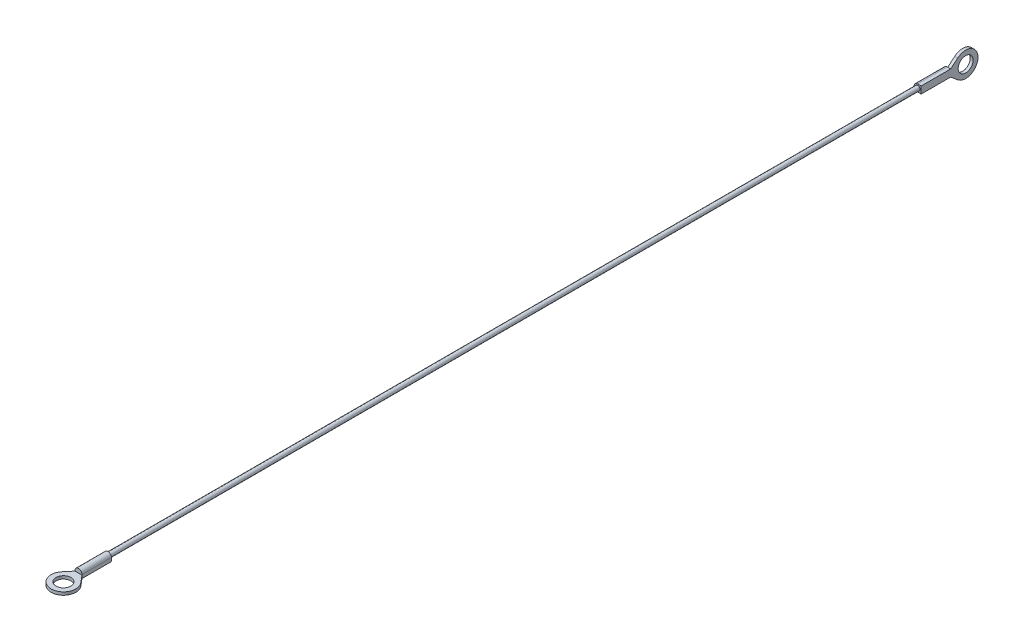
ISO-10303-21;
HEADER;
FILE_DESCRIPTION(('STEP AP214'),'2;1');
FILE_NAME('part.step','',(''),(''),'','','');
FILE_SCHEMA(('AUTOMOTIVE_DESIGN { 1 0 10303 214 1 1 1 1 }'));
ENDSEC;
DATA;
#1=APPLICATION_CONTEXT('core data for automotive mechanical design processes');
#2=APPLICATION_PROTOCOL_DEFINITION('international standard','automotive_design',2000,#1);
#3=PRODUCT_CONTEXT('',#1,'mechanical');
#4=PRODUCT('Part','Part','',(#3));
#5=PRODUCT_RELATED_PRODUCT_CATEGORY('part','',(#4));
#6=PRODUCT_DEFINITION_FORMATION('','',#4);
#7=PRODUCT_DEFINITION_CONTEXT('part definition',#1,'design');
#8=PRODUCT_DEFINITION('design','',#6,#7);
#9=PRODUCT_DEFINITION_SHAPE('','',#8);
#10=(LENGTH_UNIT() NAMED_UNIT(*) SI_UNIT(.MILLI.,.METRE.));
#11=(NAMED_UNIT(*) PLANE_ANGLE_UNIT() SI_UNIT($,.RADIAN.));
#12=(NAMED_UNIT(*) SI_UNIT($,.STERADIAN.) SOLID_ANGLE_UNIT());
#13=UNCERTAINTY_MEASURE_WITH_UNIT(LENGTH_MEASURE(1.E-05),#10,'distance_accuracy_value','');
#14=(GEOMETRIC_REPRESENTATION_CONTEXT(3) GLOBAL_UNCERTAINTY_ASSIGNED_CONTEXT((#13)) GLOBAL_UNIT_ASSIGNED_CONTEXT((#10,
#11,#12)) REPRESENTATION_CONTEXT('',''));
#15=CARTESIAN_POINT('',(0.,0.,0.));
#16=DIRECTION('',(0.,0.,1.));
#17=DIRECTION('',(1.,0.,0.));
#18=AXIS2_PLACEMENT_3D('',#15,#16,#17);
#19=CARTESIAN_POINT('',(0.,0.,-147.32));
#20=DIRECTION('',(0.,0.,-1.));
#21=DIRECTION('',(-1.,0.,0.));
#22=AXIS2_PLACEMENT_3D('',#19,#20,#21);
#23=PLANE('',#22);
#24=DIRECTION('',(1.,0.,0.));
#25=VECTOR('',#24,1.);
#26=CARTESIAN_POINT('',(0.,1.195,-147.32));
#27=LINE('',#26,#25);
#28=CARTESIAN_POINT('',(0.,1.195,-147.32));
#29=VERTEX_POINT('',#28);
#30=CARTESIAN_POINT('',(0.185,1.195,-147.32));
#31=VERTEX_POINT('',#30);
#32=EDGE_CURVE('E196',#29,#31,#27,.T.);
#33=ORIENTED_EDGE('',*,*,#32,.T.);
#34=DIRECTION('',(0.,-1.,0.));
#35=VECTOR('',#34,1.);
#36=CARTESIAN_POINT('',(0.185,-1.195,-147.32));
#37=LINE('',#36,#35);
#38=CARTESIAN_POINT('',(0.185,-1.195,-147.32));
#39=VERTEX_POINT('',#38);
#40=EDGE_CURVE('E154',#31,#39,#37,.T.);
#41=ORIENTED_EDGE('',*,*,#40,.T.);
#42=DIRECTION('',(-1.,0.,0.));
#43=VECTOR('',#42,1.);
#44=CARTESIAN_POINT('',(1.195,-1.195,-147.32));
#45=LINE('',#44,#43);
#46=CARTESIAN_POINT('',(0.,-1.195,-147.32));
#47=VERTEX_POINT('',#46);
#48=EDGE_CURVE('E201',#39,#47,#45,.T.);
#49=ORIENTED_EDGE('',*,*,#48,.T.);
#50=CARTESIAN_POINT('',(0.,0.,-147.32));
#51=DIRECTION('',(0.,0.,-1.));
#52=DIRECTION('',(-1.,0.,0.));
#53=AXIS2_PLACEMENT_3D('',#50,#51,#52);
#54=CIRCLE('',#53,1.195);
#55=EDGE_CURVE('E192',#47,#29,#54,.T.);
#56=ORIENTED_EDGE('',*,*,#55,.T.);
#57=EDGE_LOOP('',(#33,#41,#49,#56));
#58=FACE_BOUND('',#57,.T.);
#59=ADVANCED_FACE('F39',(#58),#23,.T.);
#60=CARTESIAN_POINT('',(0.,0.,147.32));
#61=DIRECTION('',(0.,0.,1.));
#62=DIRECTION('',(1.,0.,0.));
#63=AXIS2_PLACEMENT_3D('',#60,#61,#62);
#64=PLANE('',#63);
#65=DIRECTION('',(0.,-1.,0.));
#66=VECTOR('',#65,1.);
#67=CARTESIAN_POINT('',(-1.195,0.,147.32));
#68=LINE('',#67,#66);
#69=CARTESIAN_POINT('',(-1.195,0.,147.32));
#70=VERTEX_POINT('',#69);
#71=CARTESIAN_POINT('',(-1.195,-0.185,147.32));
#72=VERTEX_POINT('',#71);
#73=EDGE_CURVE('E279',#70,#72,#68,.T.);
#74=ORIENTED_EDGE('',*,*,#73,.T.);
#75=DIRECTION('',(1.,0.,0.));
#76=VECTOR('',#75,1.);
#77=CARTESIAN_POINT('',(-1.195,-0.185,147.32));
#78=LINE('',#77,#76);
#79=CARTESIAN_POINT('',(1.195,-0.185,147.32));
#80=VERTEX_POINT('',#79);
#81=EDGE_CURVE('E241',#72,#80,#78,.T.);
#82=ORIENTED_EDGE('',*,*,#81,.T.);
#83=DIRECTION('',(0.,1.,0.));
#84=VECTOR('',#83,1.);
#85=CARTESIAN_POINT('',(1.195,-1.195,147.32));
#86=LINE('',#85,#84);
#87=CARTESIAN_POINT('',(1.195,0.,147.32));
#88=VERTEX_POINT('',#87);
#89=EDGE_CURVE('E284',#80,#88,#86,.T.);
#90=ORIENTED_EDGE('',*,*,#89,.T.);
#91=CARTESIAN_POINT('',(0.,0.,147.32));
#92=DIRECTION('',(0.,0.,1.));
#93=DIRECTION('',(1.,0.,0.));
#94=AXIS2_PLACEMENT_3D('',#91,#92,#93);
#95=CIRCLE('',#94,1.195);
#96=EDGE_CURVE('E275',#88,#70,#95,.T.);
#97=ORIENTED_EDGE('',*,*,#96,.T.);
#98=EDGE_LOOP('',(#74,#82,#90,#97));
#99=FACE_BOUND('',#98,.T.);
#100=ADVANCED_FACE('F339',(#99),#64,.T.);
#101=CARTESIAN_POINT('',(0.,0.,137.32));
#102=DIRECTION('',(0.,0.,-1.));
#103=DIRECTION('',(-1.,0.,0.));
#104=AXIS2_PLACEMENT_3D('',#101,#102,#103);
#105=CYLINDRICAL_SURFACE('',#104,0.795);
#106=CARTESIAN_POINT('',(0.,0.,137.32));
#107=DIRECTION('',(0.,0.,1.));
#108=DIRECTION('',(1.,0.,0.));
#109=AXIS2_PLACEMENT_3D('',#106,#107,#108);
#110=CIRCLE('',#109,0.795);
#111=CARTESIAN_POINT('',(0.795,0.,137.32));
#112=VERTEX_POINT('',#111);
#113=EDGE_CURVE('E11',#112,#112,#110,.T.);
#114=ORIENTED_EDGE('',*,*,#113,.F.);
#115=EDGE_LOOP('',(#114));
#116=FACE_BOUND('',#115,.T.);
#117=CARTESIAN_POINT('',(0.,0.,-137.32));
#118=DIRECTION('',(0.,0.,1.));
#119=DIRECTION('',(1.,0.,0.));
#120=AXIS2_PLACEMENT_3D('',#117,#118,#119);
#121=CIRCLE('',#120,0.795);
#122=CARTESIAN_POINT('',(0.795,0.,-137.32));
#123=VERTEX_POINT('',#122);
#124=EDGE_CURVE('E43',#123,#123,#121,.T.);
#125=ORIENTED_EDGE('',*,*,#124,.T.);
#126=EDGE_LOOP('',(#125));
#127=FACE_BOUND('',#126,.T.);
#128=ADVANCED_FACE('F41',(#116,#127),#105,.T.);
#129=CARTESIAN_POINT('',(0.,0.,147.32));
#130=DIRECTION('',(0.,0.,-1.));
#131=DIRECTION('',(-1.,0.,0.));
#132=AXIS2_PLACEMENT_3D('',#129,#130,#131);
#133=CYLINDRICAL_SURFACE('',#132,1.195);
#134=CARTESIAN_POINT('',(0.,0.,137.32));
#135=DIRECTION('',(0.,0.,1.));
#136=DIRECTION('',(1.,0.,0.));
#137=AXIS2_PLACEMENT_3D('',#134,#135,#136);
#138=CIRCLE('',#137,1.195);
#139=CARTESIAN_POINT('',(1.195,0.,137.32));
#140=VERTEX_POINT('',#139);
#141=CARTESIAN_POINT('',(-1.195,0.,137.32));
#142=VERTEX_POINT('',#141);
#143=EDGE_CURVE('E270',#140,#142,#138,.T.);
#144=ORIENTED_EDGE('',*,*,#143,.T.);
#145=DIRECTION('',(0.,0.,-1.));
#146=VECTOR('',#145,1.);
#147=CARTESIAN_POINT('',(-1.195,0.,147.32));
#148=LINE('',#147,#146);
#149=EDGE_CURVE('E49',#70,#142,#148,.T.);
#150=ORIENTED_EDGE('',*,*,#149,.F.);
#151=ORIENTED_EDGE('',*,*,#96,.F.);
#152=DIRECTION('',(0.,0.,-1.));
#153=VECTOR('',#152,1.);
#154=CARTESIAN_POINT('',(1.195,0.,147.32));
#155=LINE('',#154,#153);
#156=EDGE_CURVE('E288',#88,#140,#155,.T.);
#157=ORIENTED_EDGE('',*,*,#156,.T.);
#158=EDGE_LOOP('',(#144,#150,#151,#157));
#159=FACE_BOUND('',#158,.T.);
#160=ADVANCED_FACE('F323',(#159),#133,.T.);
#161=CARTESIAN_POINT('',(-1.195,0.,147.32));
#162=DIRECTION('',(1.,0.,0.));
#163=DIRECTION('',(0.,1.,0.));
#164=AXIS2_PLACEMENT_3D('',#161,#162,#163);
#165=PLANE('',#164);
#166=DIRECTION('',(0.,-1.,0.));
#167=VECTOR('',#166,1.);
#168=CARTESIAN_POINT('',(-1.195,0.,137.32));
#169=LINE('',#168,#167);
#170=CARTESIAN_POINT('',(-1.195,-1.195,137.32));
#171=VERTEX_POINT('',#170);
#172=EDGE_CURVE('E292',#142,#171,#169,.T.);
#173=ORIENTED_EDGE('',*,*,#172,.T.);
#174=DIRECTION('',(0.,0.,-1.));
#175=VECTOR('',#174,1.);
#176=CARTESIAN_POINT('',(-1.195,-1.195,147.32));
#177=LINE('',#176,#175);
#178=CARTESIAN_POINT('',(-1.195,-1.195,147.32));
#179=VERTEX_POINT('',#178);
#180=EDGE_CURVE('E308',#179,#171,#177,.T.);
#181=ORIENTED_EDGE('',*,*,#180,.F.);
#182=DIRECTION('',(0.,-1.,0.));
#183=VECTOR('',#182,1.);
#184=CARTESIAN_POINT('',(-1.195,-0.185,147.32));
#185=LINE('',#184,#183);
#186=EDGE_CURVE('E267',#72,#179,#185,.T.);
#187=ORIENTED_EDGE('',*,*,#186,.F.);
#188=ORIENTED_EDGE('',*,*,#73,.F.);
#189=ORIENTED_EDGE('',*,*,#149,.T.);
#190=EDGE_LOOP('',(#173,#181,#187,#188,#189));
#191=FACE_BOUND('',#190,.T.);
#192=ADVANCED_FACE('F317',(#191),#165,.F.);
#193=CARTESIAN_POINT('',(0.,-1.195,147.32));
#194=DIRECTION('',(0.,1.,0.));
#195=DIRECTION('',(0.,0.,1.));
#196=AXIS2_PLACEMENT_3D('',#193,#194,#195);
#197=PLANE('',#196);
#198=DIRECTION('',(1.,0.,0.));
#199=VECTOR('',#198,1.);
#200=CARTESIAN_POINT('',(0.,-1.195,137.32));
#201=LINE('',#200,#199);
#202=CARTESIAN_POINT('',(1.195,-1.195,137.32));
#203=VERTEX_POINT('',#202);
#204=EDGE_CURVE('E296',#171,#203,#201,.T.);
#205=ORIENTED_EDGE('',*,*,#204,.T.);
#206=DIRECTION('',(0.,0.,-1.));
#207=VECTOR('',#206,1.);
#208=CARTESIAN_POINT('',(1.195,-1.195,147.32));
#209=LINE('',#208,#207);
#210=CARTESIAN_POINT('',(1.195,-1.195,147.32));
#211=VERTEX_POINT('',#210);
#212=EDGE_CURVE('E304',#211,#203,#209,.T.);
#213=ORIENTED_EDGE('',*,*,#212,.F.);
#214=DIRECTION('',(0.645049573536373,0.,0.764140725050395));
#215=VECTOR('',#214,1.);
#216=CARTESIAN_POINT('',(1.195,-1.195,147.32));
#217=LINE('',#216,#215);
#218=CARTESIAN_POINT('',(3.20174963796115,-1.195,149.697242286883));
#219=VERTEX_POINT('',#218);
#220=EDGE_CURVE('E236',#211,#219,#217,.T.);
#221=ORIENTED_EDGE('',*,*,#220,.T.);
#222=CARTESIAN_POINT('',(0.,-1.195,152.4));
#223=DIRECTION('',(0.,-1.,0.));
#224=DIRECTION('',(0.,0.,-1.));
#225=AXIS2_PLACEMENT_3D('',#222,#223,#224);
#226=CIRCLE('',#225,4.19);
#227=CARTESIAN_POINT('',(-3.20174963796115,-1.195,149.697242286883));
#228=VERTEX_POINT('',#227);
#229=EDGE_CURVE('E260',#219,#228,#226,.T.);
#230=ORIENTED_EDGE('',*,*,#229,.T.);
#231=DIRECTION('',(0.645049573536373,0.,-0.764140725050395));
#232=VECTOR('',#231,1.);
#233=CARTESIAN_POINT('',(-3.20174963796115,-1.195,149.697242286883));
#234=LINE('',#233,#232);
#235=EDGE_CURVE('E245',#228,#179,#234,.T.);
#236=ORIENTED_EDGE('',*,*,#235,.T.);
#237=ORIENTED_EDGE('',*,*,#180,.T.);
#238=EDGE_LOOP('',(#205,#213,#221,#230,#236,#237));
#239=FACE_BOUND('',#238,.T.);
#240=CARTESIAN_POINT('',(0.,-1.195,152.4));
#241=DIRECTION('',(0.,-1.,0.));
#242=DIRECTION('',(0.,0.,-1.));
#243=AXIS2_PLACEMENT_3D('',#240,#241,#242);
#244=CIRCLE('',#243,2.54);
#245=CARTESIAN_POINT('',(0.,-1.195,149.86));
#246=VERTEX_POINT('',#245);
#247=EDGE_CURVE('E237',#246,#246,#244,.T.);
#248=ORIENTED_EDGE('',*,*,#247,.F.);
#249=EDGE_LOOP('',(#248));
#250=FACE_BOUND('',#249,.T.);
#251=ADVANCED_FACE('F330',(#239,#250),#197,.F.);
#252=CARTESIAN_POINT('',(1.195,-1.195,147.32));
#253=DIRECTION('',(-1.,0.,0.));
#254=DIRECTION('',(0.,-1.,0.));
#255=AXIS2_PLACEMENT_3D('',#252,#253,#254);
#256=PLANE('',#255);
#257=DIRECTION('',(0.,1.,0.));
#258=VECTOR('',#257,1.);
#259=CARTESIAN_POINT('',(1.195,-1.195,137.32));
#260=LINE('',#259,#258);
#261=EDGE_CURVE('E280',#203,#140,#260,.T.);
#262=ORIENTED_EDGE('',*,*,#261,.T.);
#263=ORIENTED_EDGE('',*,*,#156,.F.);
#264=ORIENTED_EDGE('',*,*,#89,.F.);
#265=EDGE_CURVE('E285',#211,#80,#86,.T.);
#266=ORIENTED_EDGE('',*,*,#265,.F.);
#267=ORIENTED_EDGE('',*,*,#212,.T.);
#268=EDGE_LOOP('',(#262,#263,#264,#266,#267));
#269=FACE_BOUND('',#268,.T.);
#270=ADVANCED_FACE('F334',(#269),#256,.F.);
#271=CARTESIAN_POINT('',(0.,0.,137.32));
#272=DIRECTION('',(0.,0.,1.));
#273=DIRECTION('',(1.,0.,0.));
#274=AXIS2_PLACEMENT_3D('',#271,#272,#273);
#275=PLANE('',#274);
#276=ORIENTED_EDGE('',*,*,#113,.T.);
#277=EDGE_LOOP('',(#276));
#278=FACE_BOUND('',#277,.T.);
#279=ORIENTED_EDGE('',*,*,#143,.F.);
#280=ORIENTED_EDGE('',*,*,#261,.F.);
#281=ORIENTED_EDGE('',*,*,#204,.F.);
#282=ORIENTED_EDGE('',*,*,#172,.F.);
#283=EDGE_LOOP('',(#279,#280,#281,#282));
#284=FACE_BOUND('',#283,.T.);
#285=ADVANCED_FACE('F327',(#278,#284),#275,.F.);
#286=CARTESIAN_POINT('',(-3.20174963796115,-0.185,149.697242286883));
#287=DIRECTION('',(-0.764140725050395,0.,-0.645049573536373));
#288=DIRECTION('',(-0.645049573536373,0.,0.764140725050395));
#289=AXIS2_PLACEMENT_3D('',#286,#287,#288);
#290=PLANE('',#289);
#291=ORIENTED_EDGE('',*,*,#235,.F.);
#292=DIRECTION('',(0.,-1.,0.));
#293=VECTOR('',#292,1.);
#294=CARTESIAN_POINT('',(-3.20174963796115,-0.185,149.697242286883));
#295=LINE('',#294,#293);
#296=CARTESIAN_POINT('',(-3.20174963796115,-0.185,149.697242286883));
#297=VERTEX_POINT('',#296);
#298=EDGE_CURVE('E271',#297,#228,#295,.T.);
#299=ORIENTED_EDGE('',*,*,#298,.F.);
#300=DIRECTION('',(0.645049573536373,0.,-0.764140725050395));
#301=VECTOR('',#300,1.);
#302=CARTESIAN_POINT('',(-3.20174963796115,-0.185,149.697242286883));
#303=LINE('',#302,#301);
#304=EDGE_CURVE('E252',#297,#72,#303,.T.);
#305=ORIENTED_EDGE('',*,*,#304,.T.);
#306=ORIENTED_EDGE('',*,*,#186,.T.);
#307=EDGE_LOOP('',(#291,#299,#305,#306));
#308=FACE_BOUND('',#307,.T.);
#309=ADVANCED_FACE('F344',(#308),#290,.T.);
#310=CARTESIAN_POINT('',(0.,-0.185,152.4));
#311=DIRECTION('',(0.,-1.,0.));
#312=DIRECTION('',(0.,0.,-1.));
#313=AXIS2_PLACEMENT_3D('',#310,#311,#312);
#314=CYLINDRICAL_SURFACE('',#313,4.19);
#315=ORIENTED_EDGE('',*,*,#229,.F.);
#316=DIRECTION('',(0.,-1.,0.));
#317=VECTOR('',#316,1.);
#318=CARTESIAN_POINT('',(3.20174963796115,-0.185,149.697242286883));
#319=LINE('',#318,#317);
#320=CARTESIAN_POINT('',(3.20174963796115,-0.185,149.697242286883));
#321=VERTEX_POINT('',#320);
#322=EDGE_CURVE('E256',#321,#219,#319,.T.);
#323=ORIENTED_EDGE('',*,*,#322,.F.);
#324=CARTESIAN_POINT('',(0.,-0.185,152.4));
#325=DIRECTION('',(0.,-1.,0.));
#326=DIRECTION('',(0.,0.,-1.));
#327=AXIS2_PLACEMENT_3D('',#324,#325,#326);
#328=CIRCLE('',#327,4.19);
#329=EDGE_CURVE('E248',#321,#297,#328,.T.);
#330=ORIENTED_EDGE('',*,*,#329,.T.);
#331=ORIENTED_EDGE('',*,*,#298,.T.);
#332=EDGE_LOOP('',(#315,#323,#330,#331));
#333=FACE_BOUND('',#332,.T.);
#334=ADVANCED_FACE('F347',(#333),#314,.T.);
#335=CARTESIAN_POINT('',(1.195,-0.185,147.32));
#336=DIRECTION('',(0.764140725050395,0.,-0.645049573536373));
#337=DIRECTION('',(-0.645049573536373,0.,-0.764140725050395));
#338=AXIS2_PLACEMENT_3D('',#335,#336,#337);
#339=PLANE('',#338);
#340=ORIENTED_EDGE('',*,*,#220,.F.);
#341=ORIENTED_EDGE('',*,*,#265,.T.);
#342=DIRECTION('',(0.645049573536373,0.,0.764140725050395));
#343=VECTOR('',#342,1.);
#344=CARTESIAN_POINT('',(1.195,-0.185,147.32));
#345=LINE('',#344,#343);
#346=EDGE_CURVE('E64',#80,#321,#345,.T.);
#347=ORIENTED_EDGE('',*,*,#346,.T.);
#348=ORIENTED_EDGE('',*,*,#322,.T.);
#349=EDGE_LOOP('',(#340,#341,#347,#348));
#350=FACE_BOUND('',#349,.T.);
#351=ADVANCED_FACE('F337',(#350),#339,.T.);
#352=CARTESIAN_POINT('',(0.,-0.185,152.4));
#353=DIRECTION('',(0.,-1.,0.));
#354=DIRECTION('',(0.,0.,-1.));
#355=AXIS2_PLACEMENT_3D('',#352,#353,#354);
#356=PLANE('',#355);
#357=CARTESIAN_POINT('',(0.,-0.185,152.4));
#358=DIRECTION('',(0.,-1.,0.));
#359=DIRECTION('',(0.,0.,-1.));
#360=AXIS2_PLACEMENT_3D('',#357,#358,#359);
#361=CIRCLE('',#360,2.54);
#362=CARTESIAN_POINT('',(0.,-0.185,149.86));
#363=VERTEX_POINT('',#362);
#364=EDGE_CURVE('E232',#363,#363,#361,.T.);
#365=ORIENTED_EDGE('',*,*,#364,.T.);
#366=EDGE_LOOP('',(#365));
#367=FACE_BOUND('',#366,.T.);
#368=ORIENTED_EDGE('',*,*,#81,.F.);
#369=ORIENTED_EDGE('',*,*,#304,.F.);
#370=ORIENTED_EDGE('',*,*,#329,.F.);
#371=ORIENTED_EDGE('',*,*,#346,.F.);
#372=EDGE_LOOP('',(#368,#369,#370,#371));
#373=FACE_BOUND('',#372,.T.);
#374=ADVANCED_FACE('F341',(#367,#373),#356,.F.);
#375=CARTESIAN_POINT('',(0.,-0.185,152.4));
#376=DIRECTION('',(0.,-1.,0.));
#377=DIRECTION('',(0.,0.,-1.));
#378=AXIS2_PLACEMENT_3D('',#375,#376,#377);
#379=CYLINDRICAL_SURFACE('',#378,2.54);
#380=ORIENTED_EDGE('',*,*,#364,.F.);
#381=EDGE_LOOP('',(#380));
#382=FACE_BOUND('',#381,.T.);
#383=ORIENTED_EDGE('',*,*,#247,.T.);
#384=EDGE_LOOP('',(#383));
#385=FACE_BOUND('',#384,.T.);
#386=ADVANCED_FACE('F385',(#382,#385),#379,.F.);
#387=CARTESIAN_POINT('',(0.,0.,-147.32));
#388=DIRECTION('',(0.,0.,1.));
#389=DIRECTION('',(1.,0.,0.));
#390=AXIS2_PLACEMENT_3D('',#387,#388,#389);
#391=CYLINDRICAL_SURFACE('',#390,1.195);
#392=CARTESIAN_POINT('',(0.,0.,-137.32));
#393=DIRECTION('',(0.,0.,-1.));
#394=DIRECTION('',(-1.,0.,0.));
#395=AXIS2_PLACEMENT_3D('',#392,#393,#394);
#396=CIRCLE('',#395,1.195);
#397=CARTESIAN_POINT('',(0.,-1.195,-137.32));
#398=VERTEX_POINT('',#397);
#399=CARTESIAN_POINT('',(0.,1.195,-137.32));
#400=VERTEX_POINT('',#399);
#401=EDGE_CURVE('E189',#398,#400,#396,.T.);
#402=ORIENTED_EDGE('',*,*,#401,.T.);
#403=DIRECTION('',(0.,0.,1.));
#404=VECTOR('',#403,1.);
#405=CARTESIAN_POINT('',(0.,1.195,-147.32));
#406=LINE('',#405,#404);
#407=EDGE_CURVE('E228',#29,#400,#406,.T.);
#408=ORIENTED_EDGE('',*,*,#407,.F.);
#409=ORIENTED_EDGE('',*,*,#55,.F.);
#410=DIRECTION('',(0.,0.,1.));
#411=VECTOR('',#410,1.);
#412=CARTESIAN_POINT('',(0.,-1.195,-147.32));
#413=LINE('',#412,#411);
#414=EDGE_CURVE('E204',#47,#398,#413,.T.);
#415=ORIENTED_EDGE('',*,*,#414,.T.);
#416=EDGE_LOOP('',(#402,#408,#409,#415));
#417=FACE_BOUND('',#416,.T.);
#418=ADVANCED_FACE('F381',(#417),#391,.T.);
#419=CARTESIAN_POINT('',(0.,1.195,-147.32));
#420=DIRECTION('',(0.,-1.,0.));
#421=DIRECTION('',(0.,0.,-1.));
#422=AXIS2_PLACEMENT_3D('',#419,#420,#421);
#423=PLANE('',#422);
#424=DIRECTION('',(1.,0.,0.));
#425=VECTOR('',#424,1.);
#426=CARTESIAN_POINT('',(0.,1.195,-137.32));
#427=LINE('',#426,#425);
#428=CARTESIAN_POINT('',(1.195,1.195,-137.32));
#429=VERTEX_POINT('',#428);
#430=EDGE_CURVE('E208',#400,#429,#427,.T.);
#431=ORIENTED_EDGE('',*,*,#430,.T.);
#432=DIRECTION('',(0.,0.,1.));
#433=VECTOR('',#432,1.);
#434=CARTESIAN_POINT('',(1.195,1.195,-147.32));
#435=LINE('',#434,#433);
#436=CARTESIAN_POINT('',(1.195,1.195,-147.32));
#437=VERTEX_POINT('',#436);
#438=EDGE_CURVE('E224',#437,#429,#435,.T.);
#439=ORIENTED_EDGE('',*,*,#438,.F.);
#440=DIRECTION('',(1.,0.,0.));
#441=VECTOR('',#440,1.);
#442=CARTESIAN_POINT('',(0.185,1.195,-147.32));
#443=LINE('',#442,#441);
#444=EDGE_CURVE('E186',#31,#437,#443,.T.);
#445=ORIENTED_EDGE('',*,*,#444,.F.);
#446=ORIENTED_EDGE('',*,*,#32,.F.);
#447=ORIENTED_EDGE('',*,*,#407,.T.);
#448=EDGE_LOOP('',(#431,#439,#445,#446,#447));
#449=FACE_BOUND('',#448,.T.);
#450=ADVANCED_FACE('F377',(#449),#423,.F.);
#451=CARTESIAN_POINT('',(1.195,0.,-147.32));
#452=DIRECTION('',(-1.,0.,0.));
#453=DIRECTION('',(0.,-1.,0.));
#454=AXIS2_PLACEMENT_3D('',#451,#452,#453);
#455=PLANE('',#454);
#456=DIRECTION('',(0.,-1.,0.));
#457=VECTOR('',#456,1.);
#458=CARTESIAN_POINT('',(1.195,0.,-137.32));
#459=LINE('',#458,#457);
#460=CARTESIAN_POINT('',(1.195,-1.195,-137.32));
#461=VERTEX_POINT('',#460);
#462=EDGE_CURVE('E212',#429,#461,#459,.T.);
#463=ORIENTED_EDGE('',*,*,#462,.T.);
#464=DIRECTION('',(0.,0.,1.));
#465=VECTOR('',#464,1.);
#466=CARTESIAN_POINT('',(1.195,-1.195,-147.32));
#467=LINE('',#466,#465);
#468=CARTESIAN_POINT('',(1.195,-1.195,-147.32));
#469=VERTEX_POINT('',#468);
#470=EDGE_CURVE('E220',#469,#461,#467,.T.);
#471=ORIENTED_EDGE('',*,*,#470,.F.);
#472=DIRECTION('',(0.,-0.645049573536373,-0.764140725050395));
#473=VECTOR('',#472,1.);
#474=CARTESIAN_POINT('',(1.195,-3.20174963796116,-149.697242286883));
#475=LINE('',#474,#473);
#476=CARTESIAN_POINT('',(1.195,-3.20174963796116,-149.697242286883));
#477=VERTEX_POINT('',#476);
#478=EDGE_CURVE('E180',#469,#477,#475,.T.);
#479=ORIENTED_EDGE('',*,*,#478,.T.);
#480=CARTESIAN_POINT('',(1.195,0.,-152.4));
#481=DIRECTION('',(1.,0.,0.));
#482=DIRECTION('',(0.,0.,1.));
#483=AXIS2_PLACEMENT_3D('',#480,#481,#482);
#484=CIRCLE('',#483,4.19);
#485=CARTESIAN_POINT('',(1.195,3.20174963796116,-149.697242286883));
#486=VERTEX_POINT('',#485);
#487=EDGE_CURVE('E149',#477,#486,#484,.T.);
#488=ORIENTED_EDGE('',*,*,#487,.T.);
#489=DIRECTION('',(0.,-0.645049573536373,0.764140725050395));
#490=VECTOR('',#489,1.);
#491=CARTESIAN_POINT('',(1.195,1.195,-147.32));
#492=LINE('',#491,#490);
#493=EDGE_CURVE('E166',#486,#437,#492,.T.);
#494=ORIENTED_EDGE('',*,*,#493,.T.);
#495=ORIENTED_EDGE('',*,*,#438,.T.);
#496=EDGE_LOOP('',(#463,#471,#479,#488,#494,#495));
#497=FACE_BOUND('',#496,.T.);
#498=CARTESIAN_POINT('',(1.195,0.,-152.4));
#499=DIRECTION('',(1.,0.,0.));
#500=DIRECTION('',(0.,0.,-1.));
#501=AXIS2_PLACEMENT_3D('',#498,#499,#500);
#502=CIRCLE('',#501,2.53999999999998);
#503=CARTESIAN_POINT('',(1.195,0.,-154.94));
#504=VERTEX_POINT('',#503);
#505=EDGE_CURVE('E173',#504,#504,#502,.T.);
#506=ORIENTED_EDGE('',*,*,#505,.F.);
#507=EDGE_LOOP('',(#506));
#508=FACE_BOUND('',#507,.T.);
#509=ADVANCED_FACE('F373',(#497,#508),#455,.F.);
#510=CARTESIAN_POINT('',(1.195,-1.195,-147.32));
#511=DIRECTION('',(0.,1.,0.));
#512=DIRECTION('',(0.,0.,1.));
#513=AXIS2_PLACEMENT_3D('',#510,#511,#512);
#514=PLANE('',#513);
#515=DIRECTION('',(-1.,0.,0.));
#516=VECTOR('',#515,1.);
#517=CARTESIAN_POINT('',(1.195,-1.195,-137.32));
#518=LINE('',#517,#516);
#519=EDGE_CURVE('E197',#461,#398,#518,.T.);
#520=ORIENTED_EDGE('',*,*,#519,.T.);
#521=ORIENTED_EDGE('',*,*,#414,.F.);
#522=ORIENTED_EDGE('',*,*,#48,.F.);
#523=EDGE_CURVE('E163',#469,#39,#45,.T.);
#524=ORIENTED_EDGE('',*,*,#523,.F.);
#525=ORIENTED_EDGE('',*,*,#470,.T.);
#526=EDGE_LOOP('',(#520,#521,#522,#524,#525));
#527=FACE_BOUND('',#526,.T.);
#528=ADVANCED_FACE('F369',(#527),#514,.F.);
#529=CARTESIAN_POINT('',(0.,0.,-137.32));
#530=DIRECTION('',(0.,0.,-1.));
#531=DIRECTION('',(-1.,0.,0.));
#532=AXIS2_PLACEMENT_3D('',#529,#530,#531);
#533=PLANE('',#532);
#534=ORIENTED_EDGE('',*,*,#124,.F.);
#535=EDGE_LOOP('',(#534));
#536=FACE_BOUND('',#535,.T.);
#537=ORIENTED_EDGE('',*,*,#401,.F.);
#538=ORIENTED_EDGE('',*,*,#519,.F.);
#539=ORIENTED_EDGE('',*,*,#462,.F.);
#540=ORIENTED_EDGE('',*,*,#430,.F.);
#541=EDGE_LOOP('',(#537,#538,#539,#540));
#542=FACE_BOUND('',#541,.T.);
#543=ADVANCED_FACE('F366',(#536,#542),#533,.F.);
#544=CARTESIAN_POINT('',(0.185,-3.20174963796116,-149.697242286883));
#545=DIRECTION('',(0.,-0.764140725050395,0.645049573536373));
#546=DIRECTION('',(0.,-0.645049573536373,-0.764140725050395));
#547=AXIS2_PLACEMENT_3D('',#544,#545,#546);
#548=PLANE('',#547);
#549=ORIENTED_EDGE('',*,*,#478,.F.);
#550=ORIENTED_EDGE('',*,*,#523,.T.);
#551=DIRECTION('',(0.,-0.645049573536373,-0.764140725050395));
#552=VECTOR('',#551,1.);
#553=CARTESIAN_POINT('',(0.185,-3.20174963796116,-149.697242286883));
#554=LINE('',#553,#552);
#555=CARTESIAN_POINT('',(0.185,-3.20174963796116,-149.697242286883));
#556=VERTEX_POINT('',#555);
#557=EDGE_CURVE('E56',#39,#556,#554,.T.);
#558=ORIENTED_EDGE('',*,*,#557,.T.);
#559=DIRECTION('',(1.,0.,0.));
#560=VECTOR('',#559,1.);
#561=CARTESIAN_POINT('',(0.185,-3.20174963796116,-149.697242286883));
#562=LINE('',#561,#560);
#563=EDGE_CURVE('E145',#556,#477,#562,.T.);
#564=ORIENTED_EDGE('',*,*,#563,.T.);
#565=EDGE_LOOP('',(#549,#550,#558,#564));
#566=FACE_BOUND('',#565,.T.);
#567=ADVANCED_FACE('F161',(#566),#548,.T.);
#568=CARTESIAN_POINT('',(0.185,1.195,-147.32));
#569=DIRECTION('',(0.,0.764140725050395,0.645049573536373));
#570=DIRECTION('',(0.,-0.645049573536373,0.764140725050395));
#571=AXIS2_PLACEMENT_3D('',#568,#569,#570);
#572=PLANE('',#571);
#573=ORIENTED_EDGE('',*,*,#493,.F.);
#574=DIRECTION('',(1.,0.,0.));
#575=VECTOR('',#574,1.);
#576=CARTESIAN_POINT('',(0.185,3.20174963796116,-149.697242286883));
#577=LINE('',#576,#575);
#578=CARTESIAN_POINT('',(0.185,3.20174963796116,-149.697242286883));
#579=VERTEX_POINT('',#578);
#580=EDGE_CURVE('E153',#579,#486,#577,.T.);
#581=ORIENTED_EDGE('',*,*,#580,.F.);
#582=DIRECTION('',(0.,-0.645049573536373,0.764140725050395));
#583=VECTOR('',#582,1.);
#584=CARTESIAN_POINT('',(0.185,1.195,-147.32));
#585=LINE('',#584,#583);
#586=EDGE_CURVE('E158',#579,#31,#585,.T.);
#587=ORIENTED_EDGE('',*,*,#586,.T.);
#588=ORIENTED_EDGE('',*,*,#444,.T.);
#589=EDGE_LOOP('',(#573,#581,#587,#588));
#590=FACE_BOUND('',#589,.T.);
#591=ADVANCED_FACE('F447',(#590),#572,.T.);
#592=CARTESIAN_POINT('',(0.185,0.,-152.4));
#593=DIRECTION('',(1.,0.,0.));
#594=DIRECTION('',(0.,0.,-1.));
#595=AXIS2_PLACEMENT_3D('',#592,#593,#594);
#596=CYLINDRICAL_SURFACE('',#595,4.19);
#597=ORIENTED_EDGE('',*,*,#487,.F.);
#598=ORIENTED_EDGE('',*,*,#563,.F.);
#599=CARTESIAN_POINT('',(0.185,0.,-152.4));
#600=DIRECTION('',(1.,0.,0.));
#601=DIRECTION('',(0.,0.,1.));
#602=AXIS2_PLACEMENT_3D('',#599,#600,#601);
#603=CIRCLE('',#602,4.19);
#604=EDGE_CURVE('E147',#556,#579,#603,.T.);
#605=ORIENTED_EDGE('',*,*,#604,.T.);
#606=ORIENTED_EDGE('',*,*,#580,.T.);
#607=EDGE_LOOP('',(#597,#598,#605,#606));
#608=FACE_BOUND('',#607,.T.);
#609=ADVANCED_FACE('F146',(#608),#596,.T.);
#610=CARTESIAN_POINT('',(0.185,0.,-152.4));
#611=DIRECTION('',(-1.,0.,0.));
#612=DIRECTION('',(0.,0.,1.));
#613=AXIS2_PLACEMENT_3D('',#610,#611,#612);
#614=PLANE('',#613);
#615=CARTESIAN_POINT('',(0.185,0.,-152.4));
#616=DIRECTION('',(1.,0.,0.));
#617=DIRECTION('',(0.,0.,-1.));
#618=AXIS2_PLACEMENT_3D('',#615,#616,#617);
#619=CIRCLE('',#618,2.53999999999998);
#620=CARTESIAN_POINT('',(0.185,0.,-154.94));
#621=VERTEX_POINT('',#620);
#622=EDGE_CURVE('E183',#621,#621,#619,.T.);
#623=ORIENTED_EDGE('',*,*,#622,.T.);
#624=EDGE_LOOP('',(#623));
#625=FACE_BOUND('',#624,.T.);
#626=ORIENTED_EDGE('',*,*,#557,.F.);
#627=ORIENTED_EDGE('',*,*,#40,.F.);
#628=ORIENTED_EDGE('',*,*,#586,.F.);
#629=ORIENTED_EDGE('',*,*,#604,.F.);
#630=EDGE_LOOP('',(#626,#627,#628,#629));
#631=FACE_BOUND('',#630,.T.);
#632=ADVANCED_FACE('F157',(#625,#631),#614,.T.);
#633=CARTESIAN_POINT('',(0.185,0.,-152.4));
#634=DIRECTION('',(1.,0.,0.));
#635=DIRECTION('',(0.,0.,-1.));
#636=AXIS2_PLACEMENT_3D('',#633,#634,#635);
#637=CYLINDRICAL_SURFACE('',#636,2.53999999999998);
#638=ORIENTED_EDGE('',*,*,#622,.F.);
#639=EDGE_LOOP('',(#638));
#640=FACE_BOUND('',#639,.T.);
#641=ORIENTED_EDGE('',*,*,#505,.T.);
#642=EDGE_LOOP('',(#641));
#643=FACE_BOUND('',#642,.T.);
#644=ADVANCED_FACE('F437',(#640,#643),#637,.F.);
#645=CLOSED_SHELL('',(#59,#100,#128,#160,#192,#251,#270,#285,#309,#334,#351,#374,#386,#418,#450,
#509,#528,#543,#567,#591,#609,#632,#644));
#646=MANIFOLD_SOLID_BREP('B2',#645);
#647=ADVANCED_BREP_SHAPE_REPRESENTATION('',(#18,#646),#14);
#648=SHAPE_DEFINITION_REPRESENTATION(#9,#647);
ENDSEC;
END-ISO-10303-21;
